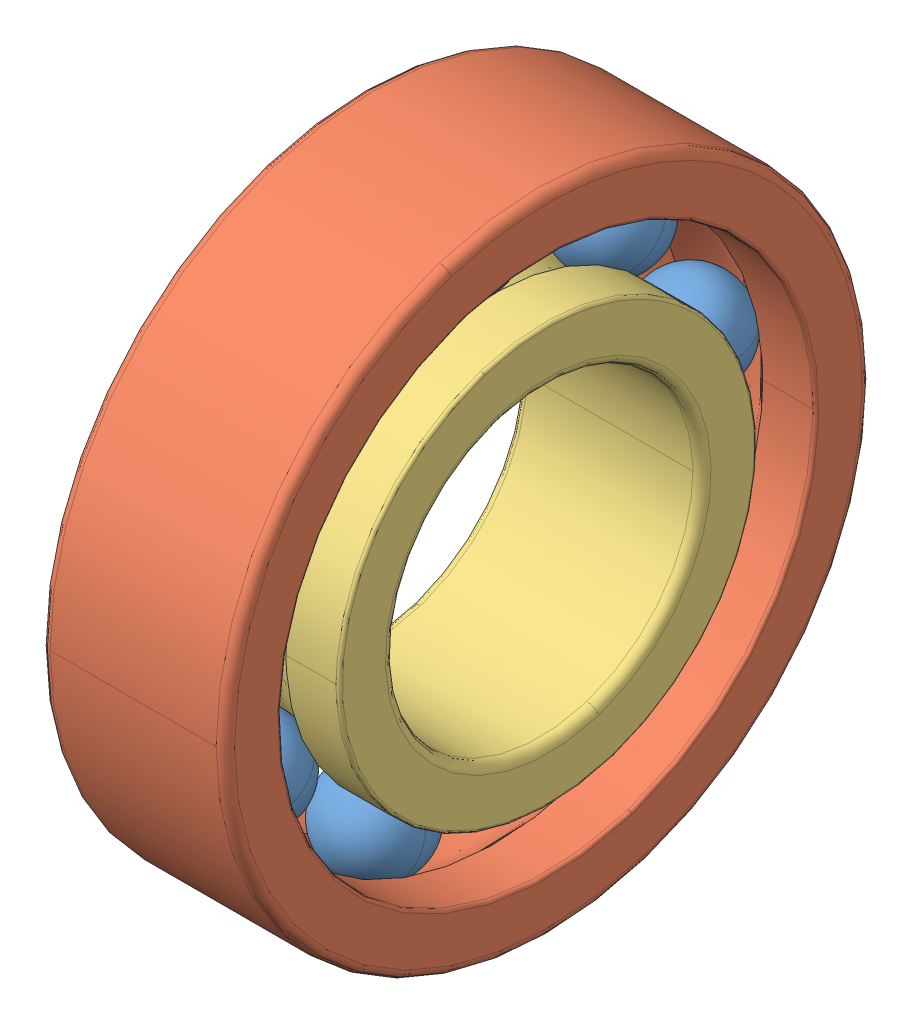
SolidWorks assembly SKF_6004.sldasm, configuration Default (file format 11000). Lengths in mm.
Overall size (12 51.41 51.41).
11 component instances, 3 part files, 0 mates.
Components (placement in the parent):
- SKF_6004_13-1: SKF_6004_13.sldprt [Default] x (1 0 0) z (0 -0.642788 0.766044) size (6.35 6.35 6.35)
- SKF_6004_13-2: SKF_6004_13.sldprt [Default] x (1 0 0) z (0 -0.984808 0.173648) size (6.35 6.35 6.35)
- SKF_6004_13-3: SKF_6004_13.sldprt [Default] x (1 0 0) z (0 -0.866025 -0.5) size (6.35 6.35 6.35)
- SKF_6004_13-4: SKF_6004_13.sldprt [Default] x (1 0 0) z (0 -0.34202 -0.939693) size (6.35 6.35 6.35)
- SKF_6004_13-5: SKF_6004_13.sldprt [Default] x (1 0 0) z (0 0.34202 -0.939693) size (6.35 6.35 6.35)
- SKF_6004_13-6: SKF_6004_13.sldprt [Default] x (1 0 0) z (0 0.866025 -0.5) size (6.35 6.35 6.35)
- SKF_6004_13-7: SKF_6004_13.sldprt [Default] x (1 0 0) z (0 0.984808 0.173648) size (6.35 6.35 6.35)
- SKF_6004_13-8: SKF_6004_13.sldprt [Default] x (1 0 0) z (0 0.642788 0.766044) size (6.35 6.35 6.35)
- SKF_6004_13-9: SKF_6004_13.sldprt [Default] at origin size (6.35 6.35 6.35)
- SKF_6004_23-1: SKF_6004_23.sldprt [Default] at origin size (12 51.41 51.41)
- SKF_6004_25-1: SKF_6004_25.sldprt [Default] at origin size (12 33.77 33.77)
